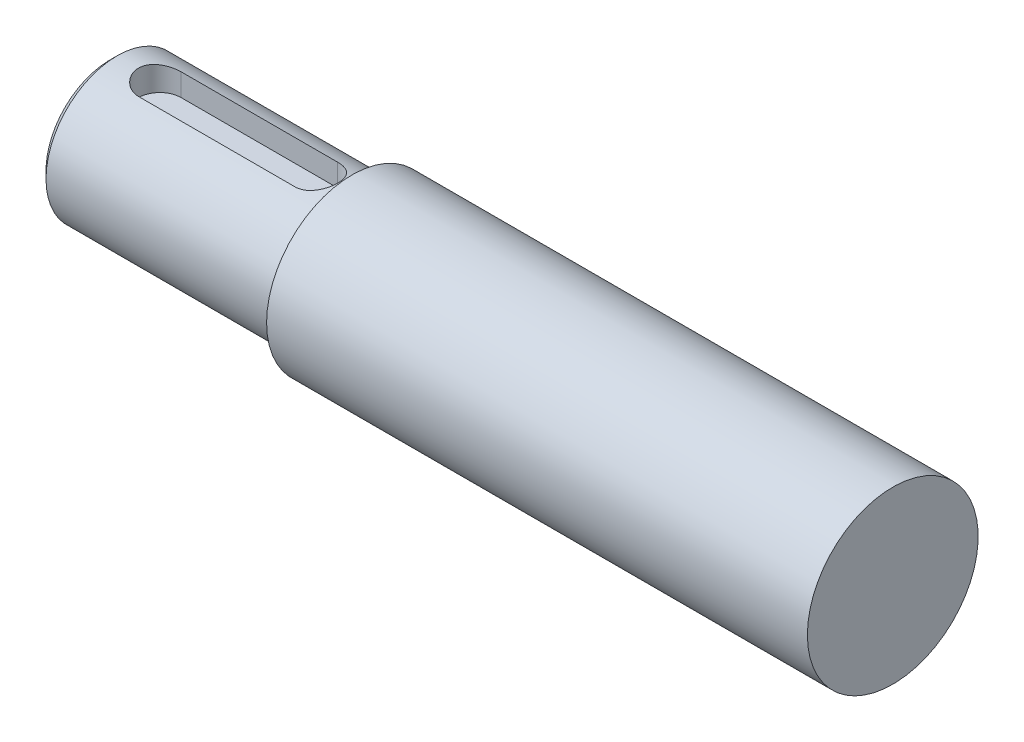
from build123d import *

# Parameters (mm, degrees)
CHANFREIN1_SIZE         = 0.5
ENL_V_MAT_EXTRU_1_DEPTH = 1.8
ESQUISSE3_R             = 2
ENL_V_MAT_EXTRU_2_DEPTH = 10


with BuildPart() as part:
    # Esquisse1 → R_volution1 (revolve)
    with BuildSketch(Plane.XY, mode=Mode.PRIVATE) as r_volution1_sk:
        Polygon((0, 0), (0, 5), (17, 5), (17, 6), (55, 6), (55, 0), align=None)
    revolve(r_volution1_sk.sketch.rotate(Axis((0, 0, 0), (1, 0, 0)), 90), axis=Axis((0, 0, 0), (1, 0, 0)))

    # Chanfrein1
    chanfrein1_edges = [part.edges().sort_by_distance(p)[0] for p in [
        (0, 0, -5),
    ]]
    chamfer(chanfrein1_edges, length=CHANFREIN1_SIZE)

    # Esquisse2 → Enl_v. mat.-Extru.1 (cut)
    with BuildSketch(Plane(origin=(0, 5, 0), x_dir=(1, 0, 0), z_dir=(0, 1, 0))):
        with BuildLine():
            Line((3.5, 1.5), (14.5, 1.5))
            ThreePointArc((14.5, 1.5), (16, 0), (14.5, -1.5))
            Line((14.5, -1.5), (3.5, -1.5))
            ThreePointArc((3.5, -1.5), (2, 0), (3.5, 1.5))
        make_face()
    extrude(amount=-ENL_V_MAT_EXTRU_1_DEPTH, mode=Mode.SUBTRACT)

    # Esquisse3 → Enl_v. mat.-Extru.2 (cut)
    with BuildSketch(Plane.ZY):
        Circle(ESQUISSE3_R)
    extrude(amount=-ENL_V_MAT_EXTRU_2_DEPTH, mode=Mode.SUBTRACT)


solid = part.part
